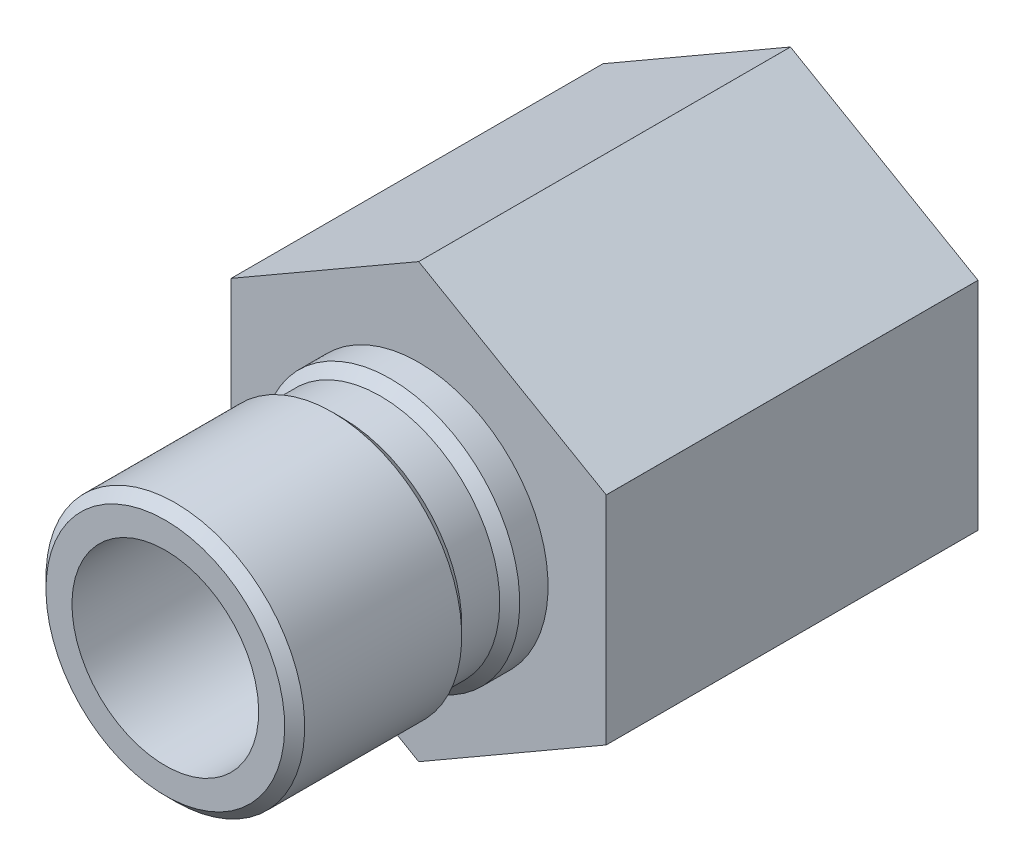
from build123d import *

# Parameters (mm, degrees)
SKETCH2_OUTSIDE_W  = 48.328
SKETCH2_OUTSIDE_H  = 48.328
CUT_EXTRUDE1_DEPTH = 37.693335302


with BuildPart() as part:
    # Sketch1 → Revolve1 (revolve)
    with BuildSketch(Plane(origin=(0, 0, 0), x_dir=(0, 0, -1), z_dir=(1, 0, 0))):
        Polygon((-19.304, 7.112), (-19.304, 9.0932), (-18.542, 9.8552), (-6.5786, 9.8552), (-5.8166, 9.0932), (-2.921, 9.0932), (-2.159, 9.8552), (0, 9.8552), (0, 16.4973), (28.321, 16.4973), (28.321, 12.303438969), (9.271, 11.70813), (6.82719433, 7.112), align=None)
    revolve(axis=Axis((0, 0, 0), (0, 0, 1)))

    # Sketch2 outside → Cut-Extrude1 (cut, through all)
    with BuildSketch(Plane.XY):
        Rectangle(SKETCH2_OUTSIDE_W, SKETCH2_OUTSIDE_H)
        Polygon((-14.2875, 8.248891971), (-14.2875, -8.248891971), (0, -16.497783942), (14.2875, -8.248891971), (14.2875, 8.248891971), (0, 16.497783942), align=None, mode=Mode.SUBTRACT)
    extrude(amount=-CUT_EXTRUDE1_DEPTH, mode=Mode.SUBTRACT)


solid = part.part
